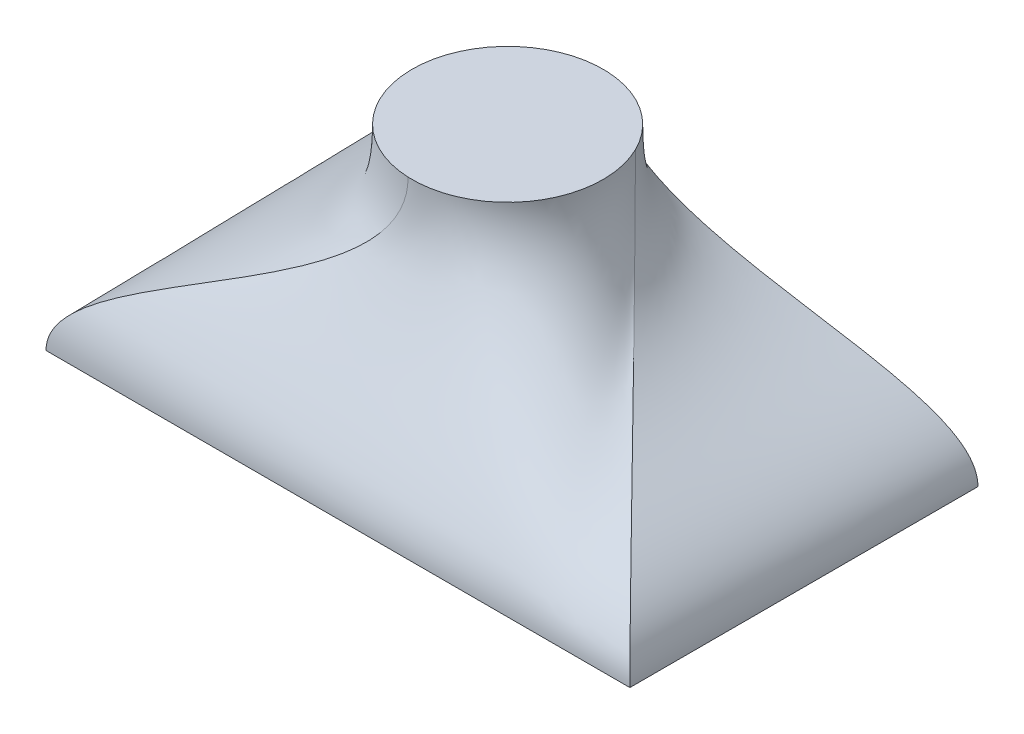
ISO-10303-21;
HEADER;
FILE_DESCRIPTION(('STEP AP214'),'2;1');
FILE_NAME('part.step','',(''),(''),'','','');
FILE_SCHEMA(('AUTOMOTIVE_DESIGN { 1 0 10303 214 1 1 1 1 }'));
ENDSEC;
DATA;
#1=APPLICATION_CONTEXT('core data for automotive mechanical design processes');
#2=APPLICATION_PROTOCOL_DEFINITION('international standard','automotive_design',2000,#1);
#3=PRODUCT_CONTEXT('',#1,'mechanical');
#4=PRODUCT('Part','Part','',(#3));
#5=PRODUCT_RELATED_PRODUCT_CATEGORY('part','',(#4));
#6=PRODUCT_DEFINITION_FORMATION('','',#4);
#7=PRODUCT_DEFINITION_CONTEXT('part definition',#1,'design');
#8=PRODUCT_DEFINITION('design','',#6,#7);
#9=PRODUCT_DEFINITION_SHAPE('','',#8);
#10=(LENGTH_UNIT() NAMED_UNIT(*) SI_UNIT(.MILLI.,.METRE.));
#11=(NAMED_UNIT(*) PLANE_ANGLE_UNIT() SI_UNIT($,.RADIAN.));
#12=(NAMED_UNIT(*) SI_UNIT($,.STERADIAN.) SOLID_ANGLE_UNIT());
#13=UNCERTAINTY_MEASURE_WITH_UNIT(LENGTH_MEASURE(1.E-05),#10,'distance_accuracy_value','');
#14=(GEOMETRIC_REPRESENTATION_CONTEXT(3) GLOBAL_UNCERTAINTY_ASSIGNED_CONTEXT((#13)) GLOBAL_UNIT_ASSIGNED_CONTEXT((#10,
#11,#12)) REPRESENTATION_CONTEXT('',''));
#15=CARTESIAN_POINT('',(0.,0.,0.));
#16=DIRECTION('',(0.,0.,1.));
#17=DIRECTION('',(1.,0.,0.));
#18=AXIS2_PLACEMENT_3D('',#15,#16,#17);
#19=CARTESIAN_POINT('',(0.,50.8,-4.57216497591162));
#20=DIRECTION('',(0.,1.,0.));
#21=DIRECTION('',(0.,0.,1.));
#22=AXIS2_PLACEMENT_3D('',#19,#20,#21);
#23=PLANE('',#22);
#24=CARTESIAN_POINT('',(0.,50.8,-4.57216497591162));
#25=DIRECTION('',(0.,1.,0.));
#26=DIRECTION('',(0.,0.,1.));
#27=AXIS2_PLACEMENT_3D('',#24,#25,#26);
#28=CIRCLE('',#27,20.8514665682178);
#29=CARTESIAN_POINT('',(-18.7469040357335,50.8,4.55675868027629));
#30=VERTEX_POINT('',#29);
#31=CARTESIAN_POINT('',(-0.882954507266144,50.8,16.2605988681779));
#32=VERTEX_POINT('',#31);
#33=EDGE_CURVE('E384',#30,#32,#28,.T.);
#34=ORIENTED_EDGE('',*,*,#33,.T.);
#35=CARTESIAN_POINT('',(12.0395406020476,50.8,12.452320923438));
#36=VERTEX_POINT('',#35);
#37=EDGE_CURVE('E391',#32,#36,#28,.T.);
#38=ORIENTED_EDGE('',*,*,#37,.T.);
#39=CARTESIAN_POINT('',(18.7469040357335,50.8,-13.7010886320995));
#40=VERTEX_POINT('',#39);
#41=EDGE_CURVE('E402',#36,#40,#28,.T.);
#42=ORIENTED_EDGE('',*,*,#41,.T.);
#43=CARTESIAN_POINT('',(0.882954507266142,50.8,-25.4049288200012));
#44=VERTEX_POINT('',#43);
#45=EDGE_CURVE('E396',#40,#44,#28,.T.);
#46=ORIENTED_EDGE('',*,*,#45,.T.);
#47=EDGE_CURVE('E375',#44,#30,#28,.T.);
#48=ORIENTED_EDGE('',*,*,#47,.T.);
#49=EDGE_LOOP('',(#34,#38,#42,#46,#48));
#50=FACE_BOUND('',#49,.T.);
#51=ADVANCED_FACE('F317',(#50),#23,.T.);
#52=CARTESIAN_POINT('',(-58.428743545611,0.,37.7502581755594));
#53=DIRECTION('',(0.,1.,0.));
#54=DIRECTION('',(0.,0.,1.));
#55=AXIS2_PLACEMENT_3D('',#52,#53,#54);
#56=PLANE('',#55);
#57=DIRECTION('',(0.,0.,1.));
#58=VECTOR('',#57,1.);
#59=CARTESIAN_POINT('',(-58.428743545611,0.,-38.2311531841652));
#60=LINE('',#59,#58);
#61=CARTESIAN_POINT('',(-58.428743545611,0.,-38.2311531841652));
#62=VERTEX_POINT('',#61);
#63=CARTESIAN_POINT('',(-58.428743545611,0.,37.7502581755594));
#64=VERTEX_POINT('',#63);
#65=EDGE_CURVE('E536',#62,#64,#60,.T.);
#66=ORIENTED_EDGE('',*,*,#65,.F.);
#67=DIRECTION('',(-1.,0.,0.));
#68=VECTOR('',#67,1.);
#69=CARTESIAN_POINT('',(-58.428743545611,0.,-38.2311531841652));
#70=LINE('',#69,#68);
#71=CARTESIAN_POINT('',(69.0084337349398,0.,-38.2311531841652));
#72=VERTEX_POINT('',#71);
#73=EDGE_CURVE('E12',#72,#62,#70,.T.);
#74=ORIENTED_EDGE('',*,*,#73,.F.);
#75=DIRECTION('',(0.,0.,-1.));
#76=VECTOR('',#75,1.);
#77=CARTESIAN_POINT('',(69.0084337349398,0.,-38.2311531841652));
#78=LINE('',#77,#76);
#79=CARTESIAN_POINT('',(69.0084337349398,0.,37.7502581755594));
#80=VERTEX_POINT('',#79);
#81=EDGE_CURVE('E329',#80,#72,#78,.T.);
#82=ORIENTED_EDGE('',*,*,#81,.F.);
#83=DIRECTION('',(1.,0.,0.));
#84=VECTOR('',#83,1.);
#85=CARTESIAN_POINT('',(-58.428743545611,0.,37.7502581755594));
#86=LINE('',#85,#84);
#87=CARTESIAN_POINT('',(40.5776843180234,0.,37.7502581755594));
#88=VERTEX_POINT('',#87);
#89=EDGE_CURVE('E552',#88,#80,#86,.T.);
#90=ORIENTED_EDGE('',*,*,#89,.F.);
#91=EDGE_CURVE('E337',#64,#88,#86,.T.);
#92=ORIENTED_EDGE('',*,*,#91,.F.);
#93=EDGE_LOOP('',(#66,#74,#82,#90,#92));
#94=FACE_BOUND('',#93,.T.);
#95=ADVANCED_FACE('F319',(#94),#56,.F.);
#96=CARTESIAN_POINT('',(-58.428743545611,0.,-38.2311531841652));
#97=CARTESIAN_POINT('',(-58.428743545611,18.0529651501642,-38.2311531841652));
#98=CARTESIAN_POINT('',(-18.7469040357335,25.0100497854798,4.55675868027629));
#99=CARTESIAN_POINT('',(-18.7469040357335,50.8,4.55675868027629));
#100=CARTESIAN_POINT('',(-58.428743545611,0.,-12.904016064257));
#101=CARTESIAN_POINT('',(-58.428743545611,18.235112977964,-12.904016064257));
#102=CARTESIAN_POINT('',(-15.3942182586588,24.7498386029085,11.4417410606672));
#103=CARTESIAN_POINT('',(-15.3942182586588,50.8,11.4417410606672));
#104=CARTESIAN_POINT('',(-58.428743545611,0.,12.4231210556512));
#105=CARTESIAN_POINT('',(-58.428743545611,18.4172608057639,12.4231210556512));
#106=CARTESIAN_POINT('',(-8.53398913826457,24.4896274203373,15.9363252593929));
#107=CARTESIAN_POINT('',(-8.53398913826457,50.8,15.9363252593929));
#108=CARTESIAN_POINT('',(-58.428743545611,0.,37.7502581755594));
#109=CARTESIAN_POINT('',(-58.428743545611,18.5994086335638,37.7502581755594));
#110=CARTESIAN_POINT('',(-0.882954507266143,24.229416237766,16.2605988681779));
#111=CARTESIAN_POINT('',(-0.882954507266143,50.8,16.2605988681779));
#112=B_SPLINE_SURFACE_WITH_KNOTS('',3,3,((#96,#97,#98,#99),(#100,#101,#102,#103),(#104,#105,
#106,#107),(#108,#109,#110,#111)),.UNSPECIFIED.,.F.,.F.,.F.,(4,4),(4,4),(0.,1.),(0.,1.),.UNSPECIFIED.);
#113=CARTESIAN_POINT('',(-58.428743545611,0.,37.7502581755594));
#114=CARTESIAN_POINT('',(-58.428743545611,18.5994086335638,37.7502581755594));
#115=CARTESIAN_POINT('',(-0.882954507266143,24.229416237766,16.2605988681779));
#116=CARTESIAN_POINT('',(-0.882954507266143,50.8,16.2605988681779));
#117=B_SPLINE_CURVE_WITH_KNOTS('',3,(#113,#114,#115,#116),.UNSPECIFIED.,.F.,.F.,(4,4),(0.,1.),.UNSPECIFIED.);
#118=EDGE_CURVE('E380',#64,#32,#117,.T.);
#119=CARTESIAN_POINT('',(-58.428743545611,0.,-38.2311531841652));
#120=CARTESIAN_POINT('',(-58.428743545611,18.0529651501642,-38.2311531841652));
#121=CARTESIAN_POINT('',(-18.7469040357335,25.0100497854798,4.55675868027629));
#122=CARTESIAN_POINT('',(-18.7469040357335,50.8,4.55675868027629));
#123=B_SPLINE_CURVE_WITH_KNOTS('',3,(#119,#120,#121,#122),.UNSPECIFIED.,.F.,.F.,(4,4),(0.,1.),.UNSPECIFIED.);
#124=EDGE_CURVE('E370',#30,#62,#123,.F.);
#125=ORIENTED_EDGE('',*,*,#65,.T.);
#126=ORIENTED_EDGE('',*,*,#118,.T.);
#127=ORIENTED_EDGE('',*,*,#33,.F.);
#128=ORIENTED_EDGE('',*,*,#124,.T.);
#129=EDGE_LOOP('',(#125,#126,#127,#128));
#130=FACE_BOUND('',#129,.T.);
#131=ADVANCED_FACE('F386',(#130),#112,.T.);
#132=CARTESIAN_POINT('',(-58.428743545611,0.,37.7502581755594));
#133=CARTESIAN_POINT('',(-58.428743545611,18.5994086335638,37.7502581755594));
#134=CARTESIAN_POINT('',(-0.882954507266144,24.229416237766,16.2605988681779));
#135=CARTESIAN_POINT('',(-0.882954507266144,50.8,16.2605988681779));
#136=CARTESIAN_POINT('',(-57.6917405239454,0.,37.7502581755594));
#137=CARTESIAN_POINT('',(-57.6917405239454,18.5131270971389,37.7502581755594));
#138=CARTESIAN_POINT('',(-0.634136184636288,24.3526755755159,16.2711445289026));
#139=CARTESIAN_POINT('',(-0.634136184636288,50.8,16.2711445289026));
#140=CARTESIAN_POINT('',(-56.5158900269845,0.,37.7502581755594));
#141=CARTESIAN_POINT('',(-56.5158900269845,18.378198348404,37.7502581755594));
#142=CARTESIAN_POINT('',(-0.285920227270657,24.5454309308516,16.2792489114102));
#143=CARTESIAN_POINT('',(-0.285920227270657,50.8000000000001,16.2792489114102));
#144=CARTESIAN_POINT('',(-54.4475876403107,0.,37.7502581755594));
#145=CARTESIAN_POINT('',(-54.4475876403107,18.1227140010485,37.7502581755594));
#146=CARTESIAN_POINT('',(0.246341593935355,24.9104085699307,16.279782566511));
#147=CARTESIAN_POINT('',(0.246341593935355,50.7999999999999,16.279782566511));
#148=CARTESIAN_POINT('',(-52.1365268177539,0.,37.7502581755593));
#149=CARTESIAN_POINT('',(-52.1365268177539,17.8315088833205,37.7502581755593));
#150=CARTESIAN_POINT('',(0.767234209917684,25.3264158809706,16.2680499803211));
#151=CARTESIAN_POINT('',(0.767234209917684,50.7999999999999,16.2680499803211));
#152=CARTESIAN_POINT('',(-48.629814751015,0.,37.7502581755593));
#153=CARTESIAN_POINT('',(-48.629814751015,17.3821667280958,37.7502581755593));
#154=CARTESIAN_POINT('',(1.44836154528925,25.9683332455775,16.2332240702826));
#155=CARTESIAN_POINT('',(1.44836154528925,50.8,16.2332240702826));
#156=CARTESIAN_POINT('',(-44.3289117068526,0.,37.7502581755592));
#157=CARTESIAN_POINT('',(-44.3289117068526,16.8315268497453,37.7502581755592));
#158=CARTESIAN_POINT('',(2.1562940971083,26.754961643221,16.1724989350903));
#159=CARTESIAN_POINT('',(2.1562940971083,50.8,16.1724989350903));
#160=CARTESIAN_POINT('',(-40.8442790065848,0.,37.7502581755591));
#161=CARTESIAN_POINT('',(-40.8442790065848,16.3974420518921,37.7502581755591));
#162=CARTESIAN_POINT('',(2.64207052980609,27.3750827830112,16.1126444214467));
#163=CARTESIAN_POINT('',(2.64207052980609,50.8,16.1126444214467));
#164=CARTESIAN_POINT('',(-36.0726923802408,0.,37.7502581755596));
#165=CARTESIAN_POINT('',(-36.0726923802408,15.8172570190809,37.7502581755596));
#166=CARTESIAN_POINT('',(3.26360475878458,28.2039185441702,16.026288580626));
#167=CARTESIAN_POINT('',(3.26360475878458,50.8,16.026288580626));
#168=CARTESIAN_POINT('',(-32.8266818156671,0.,37.7502581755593));
#169=CARTESIAN_POINT('',(-32.8266818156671,15.4383102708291,37.7502581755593));
#170=CARTESIAN_POINT('',(3.63839177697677,28.7452710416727,15.9627854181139));
#171=CARTESIAN_POINT('',(3.63839177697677,50.8,15.9627854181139));
#172=CARTESIAN_POINT('',(-27.3311999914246,0.,37.7502581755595));
#173=CARTESIAN_POINT('',(-27.3311999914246,14.8549327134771,37.7502581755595));
#174=CARTESIAN_POINT('',(4.21521523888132,29.5786675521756,15.849939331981));
#175=CARTESIAN_POINT('',(4.21521523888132,50.8,15.849939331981));
#176=CARTESIAN_POINT('',(-23.7360453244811,0.,37.7502581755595));
#177=CARTESIAN_POINT('',(-23.7360453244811,14.4929453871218,37.7502581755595));
#178=CARTESIAN_POINT('',(4.57274427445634,30.0957923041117,15.7741202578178));
#179=CARTESIAN_POINT('',(4.57274427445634,50.8,15.7741202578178));
#180=CARTESIAN_POINT('',(-18.7272173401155,0.,37.7502581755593));
#181=CARTESIAN_POINT('',(-18.7272173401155,14.0560332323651,37.7502581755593));
#182=CARTESIAN_POINT('',(5.03592678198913,30.7199525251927,15.6633189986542));
#183=CARTESIAN_POINT('',(5.03592678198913,50.8,15.6633189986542));
#184=CARTESIAN_POINT('',(-11.5596735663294,0.,37.7502581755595));
#185=CARTESIAN_POINT('',(-11.5596735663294,13.5125442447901,37.7502581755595));
#186=CARTESIAN_POINT('',(5.67331558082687,31.4963653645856,15.4979955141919));
#187=CARTESIAN_POINT('',(5.67331558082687,50.8,15.4979955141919));
#188=CARTESIAN_POINT('',(-4.5186324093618,0.,37.7502581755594));
#189=CARTESIAN_POINT('',(-4.5186324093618,13.1559202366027,37.7502581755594));
#190=CARTESIAN_POINT('',(6.26856725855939,32.0058282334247,15.3205405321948));
#191=CARTESIAN_POINT('',(6.26856725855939,50.8,15.3205405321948));
#192=CARTESIAN_POINT('',(2.28421480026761,0.,37.7502581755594));
#193=CARTESIAN_POINT('',(2.28421480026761,13.0123825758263,37.7502581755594));
#194=CARTESIAN_POINT('',(6.86779848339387,32.2108820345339,15.1173463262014));
#195=CARTESIAN_POINT('',(6.86779848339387,50.8000000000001,15.1173463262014));
#196=CARTESIAN_POINT('',(6.68719493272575,0.,37.7502581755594));
#197=CARTESIAN_POINT('',(6.68719493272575,12.9778934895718,37.7502581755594));
#198=CARTESIAN_POINT('',(7.26744850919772,32.2601521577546,14.973991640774));
#199=CARTESIAN_POINT('',(7.26744850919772,50.8,14.973991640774));
#200=CARTESIAN_POINT('',(12.6378809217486,0.,37.7502581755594));
#201=CARTESIAN_POINT('',(12.6378809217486,13.0317377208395,37.7502581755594));
#202=CARTESIAN_POINT('',(7.8357852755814,32.1832318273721,14.7557807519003));
#203=CARTESIAN_POINT('',(7.8357852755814,50.8,14.7557807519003));
#204=CARTESIAN_POINT('',(17.897698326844,0.,37.7502581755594));
#205=CARTESIAN_POINT('',(17.897698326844,13.2073130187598,37.7502581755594));
#206=CARTESIAN_POINT('',(8.39344981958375,31.9324099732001,14.5193389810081));
#207=CARTESIAN_POINT('',(8.39344981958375,50.7999999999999,14.5193389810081));
#208=CARTESIAN_POINT('',(23.768528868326,0.,37.7502581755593));
#209=CARTESIAN_POINT('',(23.768528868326,13.4933166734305,37.7502581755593));
#210=CARTESIAN_POINT('',(9.08564420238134,31.5238333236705,14.2002255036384));
#211=CARTESIAN_POINT('',(9.08564420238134,50.7999999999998,14.2002255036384));
#212=CARTESIAN_POINT('',(28.1165742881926,0.,37.7502581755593));
#213=CARTESIAN_POINT('',(28.1165742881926,13.7726686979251,37.7502581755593));
#214=CARTESIAN_POINT('',(9.66299917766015,31.1247590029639,13.9119200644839));
#215=CARTESIAN_POINT('',(9.66299917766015,50.7999999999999,13.9119200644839));
#216=CARTESIAN_POINT('',(32.9552378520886,0.,37.7502581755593));
#217=CARTESIAN_POINT('',(32.9552378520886,14.1426527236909,37.7502581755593));
#218=CARTESIAN_POINT('',(10.4186631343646,30.5962103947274,13.4949458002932));
#219=CARTESIAN_POINT('',(10.4186631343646,50.8,13.4949458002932));
#220=CARTESIAN_POINT('',(36.3470043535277,0.,37.7502581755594));
#221=CARTESIAN_POINT('',(36.3470043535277,14.4329563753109,37.7502581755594));
#222=CARTESIAN_POINT('',(11.0356788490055,30.1814908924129,13.1261901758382));
#223=CARTESIAN_POINT('',(11.0356788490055,50.7999999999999,13.1261901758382));
#224=CARTESIAN_POINT('',(38.9701051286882,0.,37.7502581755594));
#225=CARTESIAN_POINT('',(38.9701051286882,14.6700801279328,37.7502581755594));
#226=CARTESIAN_POINT('',(11.6165458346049,29.8427426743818,12.7467366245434));
#227=CARTESIAN_POINT('',(11.6165458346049,50.8,12.7467366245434));
#228=CARTESIAN_POINT('',(40.1834149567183,0.,37.7502581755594));
#229=CARTESIAN_POINT('',(40.1834149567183,14.7860134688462,37.7502581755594));
#230=CARTESIAN_POINT('',(11.930926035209,29.677123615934,12.5291320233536));
#231=CARTESIAN_POINT('',(11.930926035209,50.8,12.5291320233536));
#232=CARTESIAN_POINT('',(40.9682760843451,0.,37.7502581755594));
#233=CARTESIAN_POINT('',(40.9682760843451,14.8572631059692,37.7502581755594));
#234=CARTESIAN_POINT('',(12.1474774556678,29.5753384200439,12.3759890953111));
#235=CARTESIAN_POINT('',(12.1474774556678,50.8,12.3759890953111));
#236=CARTESIAN_POINT('',(41.5687559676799,0.,37.7502581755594));
#237=CARTESIAN_POINT('',(41.5687559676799,14.9152713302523,37.7502581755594));
#238=CARTESIAN_POINT('',(12.3370595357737,29.492469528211,12.2393324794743));
#239=CARTESIAN_POINT('',(12.3370595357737,50.8,12.2393324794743));
#240=CARTESIAN_POINT('',(42.5477172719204,0.,37.7502581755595));
#241=CARTESIAN_POINT('',(42.5477172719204,15.0063246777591,37.7502581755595));
#242=CARTESIAN_POINT('',(12.6940817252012,29.362393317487,11.9727282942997));
#243=CARTESIAN_POINT('',(12.6940817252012,50.8,11.9727282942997));
#244=CARTESIAN_POINT('',(43.5911815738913,0.,37.7502581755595));
#245=CARTESIAN_POINT('',(43.5911815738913,15.1046008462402,37.7502581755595));
#246=CARTESIAN_POINT('',(13.1362628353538,29.2219987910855,11.6269937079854));
#247=CARTESIAN_POINT('',(13.1362628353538,50.8000000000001,11.6269937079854));
#248=CARTESIAN_POINT('',(44.7781266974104,0.,37.7502581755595));
#249=CARTESIAN_POINT('',(44.7781266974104,15.2174531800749,37.7502581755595));
#250=CARTESIAN_POINT('',(13.7184432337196,29.0607811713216,11.13938173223));
#251=CARTESIAN_POINT('',(13.7184432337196,50.8000000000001,11.13938173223));
#252=CARTESIAN_POINT('',(45.8573299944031,0.,37.7502581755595));
#253=CARTESIAN_POINT('',(45.8573299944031,15.3231812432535,37.7502581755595));
#254=CARTESIAN_POINT('',(14.3162550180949,28.9097410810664,10.5974794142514));
#255=CARTESIAN_POINT('',(14.3162550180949,50.8,10.5974794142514));
#256=CARTESIAN_POINT('',(47.0087502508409,0.,37.7502581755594));
#257=CARTESIAN_POINT('',(47.0087502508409,15.4408035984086,37.7502581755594));
#258=CARTESIAN_POINT('',(15.0126013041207,28.7417091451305,9.91374542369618));
#259=CARTESIAN_POINT('',(15.0126013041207,50.8,9.91374542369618));
#260=CARTESIAN_POINT('',(48.0748610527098,0.,37.7502581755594));
#261=CARTESIAN_POINT('',(48.0748610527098,15.5570691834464,37.7502581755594));
#262=CARTESIAN_POINT('',(15.7132950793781,28.5756154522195,9.1564093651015));
#263=CARTESIAN_POINT('',(15.7132950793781,50.8000000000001,9.1564093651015));
#264=CARTESIAN_POINT('',(49.181919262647,0.,37.7502581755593));
#265=CARTESIAN_POINT('',(49.181919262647,15.6902379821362,37.7502581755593));
#266=CARTESIAN_POINT('',(16.4854772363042,28.385374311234,8.21638343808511));
#267=CARTESIAN_POINT('',(16.4854772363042,50.8000000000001,8.21638343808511));
#268=CARTESIAN_POINT('',(50.3489189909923,0.,37.7502581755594));
#269=CARTESIAN_POINT('',(50.3489189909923,15.8461875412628,37.7502581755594));
#270=CARTESIAN_POINT('',(17.331331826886,28.1625892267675,7.06288121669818));
#271=CARTESIAN_POINT('',(17.331331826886,50.8,7.06288121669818));
#272=CARTESIAN_POINT('',(51.5219531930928,0.,37.7502581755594));
#273=CARTESIAN_POINT('',(51.5219531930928,16.0302745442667,37.7502581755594));
#274=CARTESIAN_POINT('',(18.1969132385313,27.8996077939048,5.66752782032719));
#275=CARTESIAN_POINT('',(18.1969132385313,50.8000000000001,5.66752782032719));
#276=CARTESIAN_POINT('',(52.5959412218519,0.,37.7502581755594));
#277=CARTESIAN_POINT('',(52.5959412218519,16.2335512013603,37.7502581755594));
#278=CARTESIAN_POINT('',(18.9512621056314,27.6092125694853,4.16283911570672));
#279=CARTESIAN_POINT('',(18.9512621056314,50.7999999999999,4.16283911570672));
#280=CARTESIAN_POINT('',(53.5480594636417,0.,37.7502581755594));
#281=CARTESIAN_POINT('',(53.5480594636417,16.4394961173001,37.7502581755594));
#282=CARTESIAN_POINT('',(19.5631134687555,27.3150055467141,2.69622298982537));
#283=CARTESIAN_POINT('',(19.5631134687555,50.8,2.69622298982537));
#284=CARTESIAN_POINT('',(54.6733994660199,0.,37.7502581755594));
#285=CARTESIAN_POINT('',(54.6733994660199,16.7162111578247,37.7502581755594));
#286=CARTESIAN_POINT('',(20.1822707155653,26.9196983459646,0.828039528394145));
#287=CARTESIAN_POINT('',(20.1822707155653,50.7999999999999,0.828039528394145));
#288=CARTESIAN_POINT('',(55.7791706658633,0.,37.7502581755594));
#289=CARTESIAN_POINT('',(55.7791706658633,17.0301011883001,37.7502581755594));
#290=CARTESIAN_POINT('',(20.5880017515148,26.4712840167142,-1.09197713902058));
#291=CARTESIAN_POINT('',(20.5880017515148,50.8000000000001,-1.09197713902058));
#292=CARTESIAN_POINT('',(56.8761466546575,0.,37.7502581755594));
#293=CARTESIAN_POINT('',(56.8761466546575,17.3607338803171,37.7502581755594));
#294=CARTESIAN_POINT('',(20.8022002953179,25.998951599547,-2.92282510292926));
#295=CARTESIAN_POINT('',(20.8022002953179,50.8,-2.92282510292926));
#296=CARTESIAN_POINT('',(57.7139136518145,0.,37.7502581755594));
#297=CARTESIAN_POINT('',(57.7139136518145,17.6193606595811,37.7502581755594));
#298=CARTESIAN_POINT('',(20.86417422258,25.6294847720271,-4.24816069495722));
#299=CARTESIAN_POINT('',(20.86417422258,50.8000000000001,-4.24816069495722));
#300=CARTESIAN_POINT('',(58.7151192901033,0.,37.7502581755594));
#301=CARTESIAN_POINT('',(58.7151192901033,17.9284334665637,37.7502581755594));
#302=CARTESIAN_POINT('',(20.8369542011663,25.1879521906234,-5.71053336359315));
#303=CARTESIAN_POINT('',(20.8369542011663,50.8,-5.71053336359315));
#304=CARTESIAN_POINT('',(59.7255358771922,0.,37.7502581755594));
#305=CARTESIAN_POINT('',(59.7255358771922,18.2359591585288,37.7502581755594));
#306=CARTESIAN_POINT('',(20.7224153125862,24.7486297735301,-7.04604320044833));
#307=CARTESIAN_POINT('',(20.7224153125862,50.8,-7.04604320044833));
#308=CARTESIAN_POINT('',(60.7248551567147,0.,37.7502581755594));
#309=CARTESIAN_POINT('',(60.7248551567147,18.5303160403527,37.7502581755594));
#310=CARTESIAN_POINT('',(20.5426967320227,24.3281199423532,-8.20509105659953));
#311=CARTESIAN_POINT('',(20.5426967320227,50.8,-8.20509105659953));
#312=CARTESIAN_POINT('',(61.7129450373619,0.,37.7502581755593));
#313=CARTESIAN_POINT('',(61.7129450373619,18.8122147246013,37.7502581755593));
#314=CARTESIAN_POINT('',(20.3337959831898,23.9254075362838,-9.23509314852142));
#315=CARTESIAN_POINT('',(20.3337959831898,50.8,-9.23509314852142));
#316=CARTESIAN_POINT('',(62.7225585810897,0.,37.7502581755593));
#317=CARTESIAN_POINT('',(62.7225585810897,19.0903361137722,37.7502581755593));
#318=CARTESIAN_POINT('',(20.0970712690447,23.5280912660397,-10.1735664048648));
#319=CARTESIAN_POINT('',(20.0970712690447,50.8,-10.1735664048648));
#320=CARTESIAN_POINT('',(63.9151507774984,0.,37.7502581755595));
#321=CARTESIAN_POINT('',(63.9151507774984,19.4028021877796,37.7502581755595));
#322=CARTESIAN_POINT('',(19.8041989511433,23.0817111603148,-11.124647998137));
#323=CARTESIAN_POINT('',(19.8041989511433,50.8,-11.124647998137));
#324=CARTESIAN_POINT('',(65.1051776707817,0.,37.7502581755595));
#325=CARTESIAN_POINT('',(65.1051776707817,19.6982657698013,37.7502581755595));
#326=CARTESIAN_POINT('',(19.5165199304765,22.6596203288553,-11.9319009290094));
#327=CARTESIAN_POINT('',(19.5165199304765,50.8,-11.9319009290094));
#328=CARTESIAN_POINT('',(66.1472482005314,0.,37.7502581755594));
#329=CARTESIAN_POINT('',(66.1472482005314,19.9422586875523,37.7502581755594));
#330=CARTESIAN_POINT('',(19.2787897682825,22.3110590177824,-12.5256473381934));
#331=CARTESIAN_POINT('',(19.2787897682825,50.8,-12.5256473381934));
#332=CARTESIAN_POINT('',(67.2147614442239,0.,37.7502581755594));
#333=CARTESIAN_POINT('',(67.2147614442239,20.1805388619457,37.7502581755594));
#334=CARTESIAN_POINT('',(19.0551350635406,21.9706587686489,-13.044986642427));
#335=CARTESIAN_POINT('',(19.0551350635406,50.8,-13.044986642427));
#336=CARTESIAN_POINT('',(67.9216622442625,0.,37.750258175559));
#337=CARTESIAN_POINT('',(67.9216622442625,20.3282755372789,37.750258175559));
#338=CARTESIAN_POINT('',(18.9216716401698,21.7596063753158,-13.3357761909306));
#339=CARTESIAN_POINT('',(18.9216716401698,50.8,-13.3357761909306));
#340=CARTESIAN_POINT('',(68.6208462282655,0.,37.7502581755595));
#341=CARTESIAN_POINT('',(68.6208462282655,20.4712023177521,37.7502581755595));
#342=CARTESIAN_POINT('',(18.8060329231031,21.5554252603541,-13.5789581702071));
#343=CARTESIAN_POINT('',(18.8060329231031,50.8,-13.5789581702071));
#344=CARTESIAN_POINT('',(68.8091583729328,0.,37.7502581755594));
#345=CARTESIAN_POINT('',(68.8091583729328,20.5089623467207,37.7502581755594));
#346=CARTESIAN_POINT('',(18.7765175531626,21.5014823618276,-13.6402751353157));
#347=CARTESIAN_POINT('',(18.7765175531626,50.8,-13.6402751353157));
#348=CARTESIAN_POINT('',(69.0084337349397,0.,37.7502581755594));
#349=CARTESIAN_POINT('',(69.0084337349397,20.5467223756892,37.7502581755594));
#350=CARTESIAN_POINT('',(18.7469040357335,21.4475394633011,-13.7010886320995));
#351=CARTESIAN_POINT('',(18.7469040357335,50.8,-13.7010886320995));
#352=B_SPLINE_SURFACE_WITH_KNOTS('',3,3,((#132,#133,#134,#135),(#136,#137,#138,#139),(#140,#141,
#142,#143),(#144,#145,#146,#147),(#148,#149,#150,#151),(#152,#153,#154,#155),(#156,#157,#158,
#159),(#160,#161,#162,#163),(#164,#165,#166,#167),(#168,#169,#170,#171),(#172,#173,#174,#175),
(#176,#177,#178,#179),(#180,#181,#182,#183),(#184,#185,#186,#187),(#188,#189,#190,#191),(#192,
#193,#194,#195),(#196,#197,#198,#199),(#200,#201,#202,#203),(#204,#205,#206,#207),(#208,#209,
#210,#211),(#212,#213,#214,#215),(#216,#217,#218,#219),(#220,#221,#222,#223),(#224,#225,#226,
#227),(#228,#229,#230,#231),(#232,#233,#234,#235),(#236,#237,#238,#239),(#240,#241,#242,#243),
(#244,#245,#246,#247),(#248,#249,#250,#251),(#252,#253,#254,#255),(#256,#257,#258,#259),(#260,
#261,#262,#263),(#264,#265,#266,#267),(#268,#269,#270,#271),(#272,#273,#274,#275),(#276,#277,
#278,#279),(#280,#281,#282,#283),(#284,#285,#286,#287),(#288,#289,#290,#291),(#292,#293,#294,
#295),(#296,#297,#298,#299),(#300,#301,#302,#303),(#304,#305,#306,#307),(#308,#309,#310,#311),
(#312,#313,#314,#315),(#316,#317,#318,#319),(#320,#321,#322,#323),(#324,#325,#326,#327),(#328,
#329,#330,#331),(#332,#333,#334,#335),(#336,#337,#338,#339),(#340,#341,#342,#343),(#344,#345,
#346,#347),(#348,#349,#350,#351)),.UNSPECIFIED.,.F.,.F.,.F.,(4,1,1,1,1,1,2,2,1,1,1,1,1,1,1,1,1,
1,1,1,1,2,1,1,1,1,1,1,1,1,1,1,1,1,1,1,1,1,1,1,1,1,1,1,1,1,1,2,4),(4,4),(0.,0.0173501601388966,
0.0271325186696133,0.0461762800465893,0.0671568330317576,0.0989346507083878,0.128321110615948,
0.17928035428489,0.208999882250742,0.230185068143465,0.246680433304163,0.302909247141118,
0.319563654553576,0.336681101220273,0.362787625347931,0.404174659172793,0.418181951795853,
0.460913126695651,0.482991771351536,0.513810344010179,0.532785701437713,0.542067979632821,
0.551273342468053,0.558149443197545,0.572073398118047,0.588000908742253,0.605718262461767,
0.62005230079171,0.643018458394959,0.66022928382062,0.679683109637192,0.708297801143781,
0.728372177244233,0.743587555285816,0.765598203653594,0.796617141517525,0.810793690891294,
0.831697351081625,0.846567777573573,0.869495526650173,0.889561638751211,0.901680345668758,
0.92201567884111,0.940935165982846,0.95822509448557,0.973671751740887,0.981474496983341,
0.995289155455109,1.),(0.,1.),.UNSPECIFIED.);
#353=CARTESIAN_POINT('',(69.0084337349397,0.,37.7502581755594));
#354=CARTESIAN_POINT('',(69.0084337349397,20.5467223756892,37.7502581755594));
#355=CARTESIAN_POINT('',(18.7469040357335,21.4475394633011,-13.7010886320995));
#356=CARTESIAN_POINT('',(18.7469040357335,50.8,-13.7010886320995));
#357=B_SPLINE_CURVE_WITH_KNOTS('',3,(#353,#354,#355,#356),.UNSPECIFIED.,.F.,.F.,(4,4),(0.,1.),.UNSPECIFIED.);
#358=EDGE_CURVE('E381',#80,#40,#357,.T.);
#359=ORIENTED_EDGE('',*,*,#91,.T.);
#360=ORIENTED_EDGE('',*,*,#89,.T.);
#361=ORIENTED_EDGE('',*,*,#358,.T.);
#362=ORIENTED_EDGE('',*,*,#41,.F.);
#363=ORIENTED_EDGE('',*,*,#37,.F.);
#364=ORIENTED_EDGE('',*,*,#118,.F.);
#365=EDGE_LOOP('',(#359,#360,#361,#362,#363,#364));
#366=FACE_BOUND('',#365,.T.);
#367=ADVANCED_FACE('F451',(#366),#352,.T.);
#368=CARTESIAN_POINT('',(69.0084337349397,0.,-38.2311531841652));
#369=CARTESIAN_POINT('',(69.0084337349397,20.053412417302,-38.2311531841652));
#370=CARTESIAN_POINT('',(0.882954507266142,22.1522679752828,-25.4049288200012));
#371=CARTESIAN_POINT('',(0.882954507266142,50.8,-25.4049288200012));
#372=CARTESIAN_POINT('',(47.7689041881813,0.,-38.2311531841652));
#373=CARTESIAN_POINT('',(47.7689041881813,17.1852507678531,-38.2311531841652));
#374=CARTESIAN_POINT('',(-6.45445753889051,26.2496417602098,-25.7159101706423));
#375=CARTESIAN_POINT('',(-6.45445753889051,50.8,-25.7159101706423));
#376=CARTESIAN_POINT('',(26.5293746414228,0.,-38.2311531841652));
#377=CARTESIAN_POINT('',(26.5293746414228,14.3170891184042,-38.2311531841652));
#378=CARTESIAN_POINT('',(-13.4168240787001,30.3470155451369,-22.1422194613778));
#379=CARTESIAN_POINT('',(-13.4168240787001,50.8,-22.1422194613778));
#380=CARTESIAN_POINT('',(-15.9496844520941,0.,-38.2311531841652));
#381=CARTESIAN_POINT('',(-15.9496844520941,13.6502733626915,-38.2311531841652));
#382=CARTESIAN_POINT('',(-21.4661719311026,31.2996094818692,-9.85623969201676));
#383=CARTESIAN_POINT('',(-21.4661719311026,50.8,-9.85623969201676));
#384=CARTESIAN_POINT('',(-37.1892139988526,0.,-38.2311531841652));
#385=CARTESIAN_POINT('',(-37.1892139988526,15.8516192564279,-38.2311531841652));
#386=CARTESIAN_POINT('',(-21.9621602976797,28.1548296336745,-2.04600226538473));
#387=CARTESIAN_POINT('',(-21.9621602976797,50.8,-2.04600226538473));
#388=CARTESIAN_POINT('',(-58.428743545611,0.,-38.2311531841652));
#389=CARTESIAN_POINT('',(-58.428743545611,18.0529651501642,-38.2311531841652));
#390=CARTESIAN_POINT('',(-18.7469040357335,25.0100497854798,4.55675868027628));
#391=CARTESIAN_POINT('',(-18.7469040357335,50.8,4.55675868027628));
#392=B_SPLINE_SURFACE_WITH_KNOTS('',3,3,((#368,#369,#370,#371),(#372,#373,#374,#375),(#376,#377,
#378,#379),(#380,#381,#382,#383),(#384,#385,#386,#387),(#388,#389,#390,#391)),.UNSPECIFIED.,.F.,
.F.,.F.,(4,2,4),(4,4),(0.,0.5,1.),(0.,1.),.UNSPECIFIED.);
#393=CARTESIAN_POINT('',(69.0084337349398,0.,-38.2311531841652));
#394=CARTESIAN_POINT('',(69.0084337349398,20.053412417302,-38.2311531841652));
#395=CARTESIAN_POINT('',(0.882954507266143,22.1522679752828,-25.4049288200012));
#396=CARTESIAN_POINT('',(0.882954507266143,50.8,-25.4049288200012));
#397=B_SPLINE_CURVE_WITH_KNOTS('',3,(#393,#394,#395,#396),.UNSPECIFIED.,.F.,.F.,(4,4),(0.,1.),.UNSPECIFIED.);
#398=EDGE_CURVE('E390',#72,#44,#397,.T.);
#399=ORIENTED_EDGE('',*,*,#73,.T.);
#400=ORIENTED_EDGE('',*,*,#124,.F.);
#401=ORIENTED_EDGE('',*,*,#47,.F.);
#402=ORIENTED_EDGE('',*,*,#398,.F.);
#403=EDGE_LOOP('',(#399,#400,#401,#402));
#404=FACE_BOUND('',#403,.T.);
#405=ADVANCED_FACE('F372',(#404),#392,.T.);
#406=CARTESIAN_POINT('',(69.0084337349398,0.,37.7502581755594));
#407=CARTESIAN_POINT('',(69.0084337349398,20.5467223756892,37.7502581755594));
#408=CARTESIAN_POINT('',(18.7469040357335,21.4475394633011,-13.7010886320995));
#409=CARTESIAN_POINT('',(18.7469040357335,50.8,-13.7010886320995));
#410=CARTESIAN_POINT('',(69.0084337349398,0.,12.4231210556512));
#411=CARTESIAN_POINT('',(69.0084337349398,20.3822857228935,12.4231210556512));
#412=CARTESIAN_POINT('',(15.3942182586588,21.682448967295,-20.5860710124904));
#413=CARTESIAN_POINT('',(15.3942182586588,50.8,-20.5860710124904));
#414=CARTESIAN_POINT('',(69.0084337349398,0.,-12.904016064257));
#415=CARTESIAN_POINT('',(69.0084337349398,20.2178490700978,-12.904016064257));
#416=CARTESIAN_POINT('',(8.53398913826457,21.9173584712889,-25.0806552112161));
#417=CARTESIAN_POINT('',(8.53398913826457,50.8,-25.0806552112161));
#418=CARTESIAN_POINT('',(69.0084337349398,0.,-38.2311531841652));
#419=CARTESIAN_POINT('',(69.0084337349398,20.053412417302,-38.2311531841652));
#420=CARTESIAN_POINT('',(0.882954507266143,22.1522679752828,-25.4049288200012));
#421=CARTESIAN_POINT('',(0.882954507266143,50.8,-25.4049288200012));
#422=B_SPLINE_SURFACE_WITH_KNOTS('',3,3,((#406,#407,#408,#409),(#410,#411,#412,#413),(#414,#415,
#416,#417),(#418,#419,#420,#421)),.UNSPECIFIED.,.F.,.F.,.F.,(4,4),(4,4),(0.,1.),(0.,1.),.UNSPECIFIED.);
#423=ORIENTED_EDGE('',*,*,#81,.T.);
#424=ORIENTED_EDGE('',*,*,#398,.T.);
#425=ORIENTED_EDGE('',*,*,#45,.F.);
#426=ORIENTED_EDGE('',*,*,#358,.F.);
#427=EDGE_LOOP('',(#423,#424,#425,#426));
#428=FACE_BOUND('',#427,.T.);
#429=ADVANCED_FACE('F429',(#428),#422,.T.);
#430=CLOSED_SHELL('',(#51,#95,#131,#367,#405,#429));
#431=MANIFOLD_SOLID_BREP('B2',#430);
#432=ADVANCED_BREP_SHAPE_REPRESENTATION('',(#18,#431),#14);
#433=SHAPE_DEFINITION_REPRESENTATION(#9,#432);
ENDSEC;
END-ISO-10303-21;
